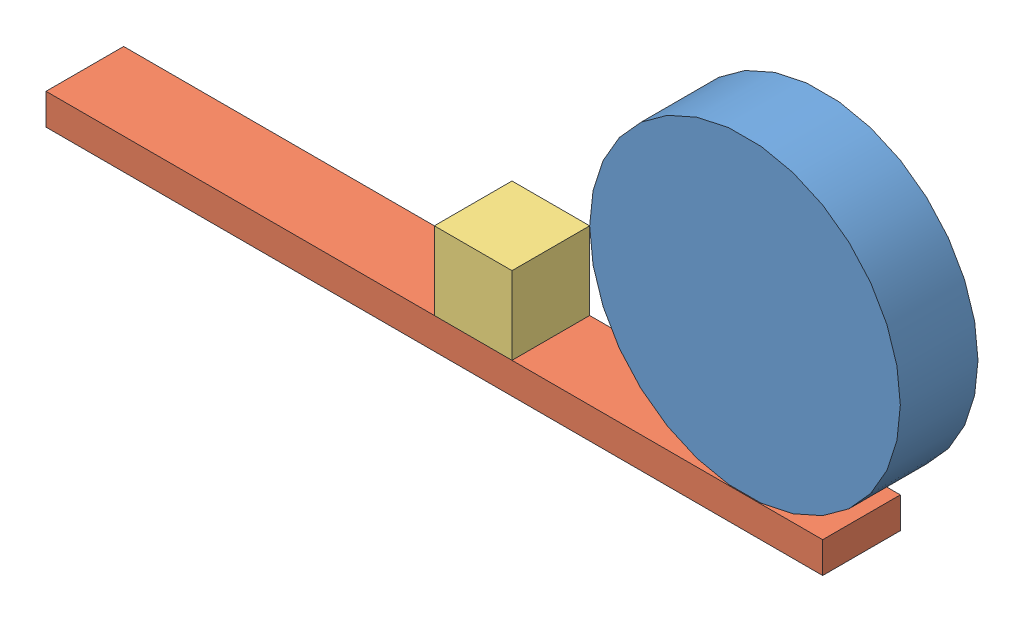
SolidWorks assembly 034957_RadUeHindernis-SWX2015.SLDASM, configuration FuerBewegung (file format 8000). Lengths in mm.
Overall size (550 220 50).
3 component instances, 3 part files, 3 mates.
Components (placement in the parent):
- 034957_Rad-SWX2015-1: 034957_Rad-SWX2015.SLDPRT [Standard] at (200 100 0) size (200 200 50)
- 034957_Platte-SWX2015-1: 034957_Platte-SWX2015.SLDPRT [Standard] at origin size (500 20 50)
- 034957_Hindernis-SWX2015-1: 034957_Hindernis-SWX2015.SLDPRT [Standard] at origin size (50 50 50)
Mates (geometry in assembly coordinates):
- Deckungsgleich1: coincident: plane of 034957_Rad-SWX2015-1 through (-240.6564 99.765 -0.0571) normal (-0.00012 0.000077 1); plane of 034957_Platte-SWX2015-1 through (0 0 0) normal (0 0 1)
- Tangential1: tangent anti-aligned: cylinder of 034957_Rad-SWX2015-1 through (200 100 50) axis (0 0 -1) radius 100; plane of 034957_Platte-SWX2015-1 through (0 0 0) normal (0 1 0)
- Abstand1: distance = 200 mm: plane of assembly through (0 0 0) normal (1 0 0); axis of 034957_Rad-SWX2015-1 through (200 100 50) axis (0 0 -1)
